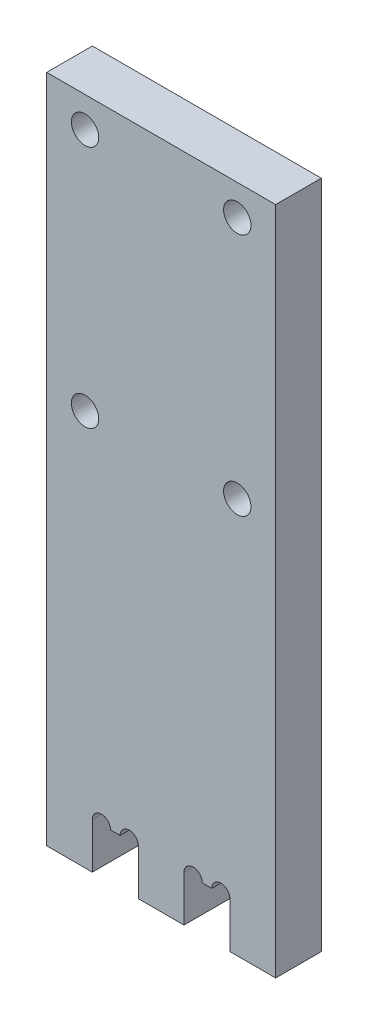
from build123d import *

# Parameters (mm, degrees)
SKIZZE1_R                       = 4.5
AUFSATZ_LINEAR_AUSTRAGEN1_DEPTH = 15


with BuildPart() as part:
    # Skizze1 → Aufsatz-Linear austragen1 (new body)
    with BuildSketch(Plane.XY):
        with BuildLine():
            Line((0, 0), (0, -15))
            Line((0, -15), (15, -15))
            Line((15, -15), (15, 0))
            ThreePointArc((15, 0), (18, 3), (21, 0))
            Line((21, 0), (24.1, 0))
            ThreePointArc((24.1, 0), (27.1, 3), (30.1, 0))
            Line((30.1, 0), (30.1, -15))
            Line((30.1, -15), (45.1, -15))
            Line((45.1, -15), (45.1, 0))
            ThreePointArc((45.1, 0), (48.1, 3), (51.1, 0))
            Line((51.1, 0), (54.2, 0))
            ThreePointArc((54.2, 0), (57.2, 3), (60.2, 0))
            Line((60.2, 0), (60.2, -15))
            Line((60.2, -15), (75.2, -15))
            Line((75.2, -15), (75.2, -8.230335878))
            Line((75.2, -8.230335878), (75.2, 205))
            Line((75.2, 205), (0, 205))
            Line((0, 205), (0, 0))
        make_face()
        with Locations((12.6, 115)):
            Circle(SKIZZE1_R, mode=Mode.SUBTRACT)
        with Locations((62.6, 115)):
            Circle(SKIZZE1_R, mode=Mode.SUBTRACT)
        with Locations((12.6, 195)):
            Circle(SKIZZE1_R, mode=Mode.SUBTRACT)
        with Locations((62.6, 195)):
            Circle(SKIZZE1_R, mode=Mode.SUBTRACT)
    extrude(amount=AUFSATZ_LINEAR_AUSTRAGEN1_DEPTH)


solid = part.part
